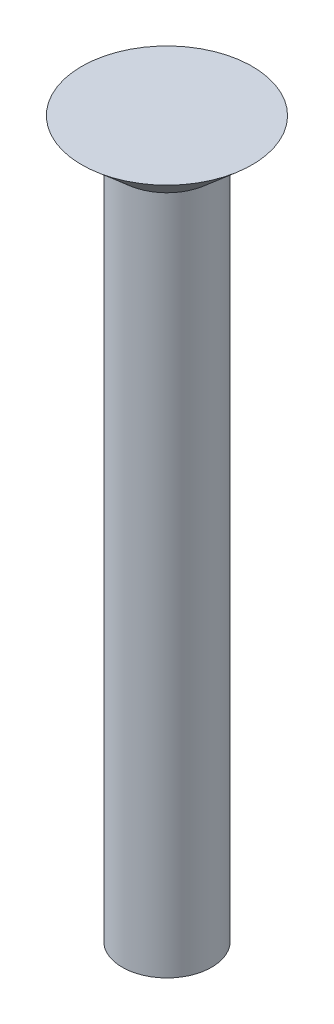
from build123d import *


with BuildPart() as part:
    # Sketch1 → Revolve1 (revolve)
    with BuildSketch(Plane.XY, mode=Mode.PRIVATE) as revolve1_sk:
        Polygon((0, 0), (6.0579, 0), (3.175, -2.506066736), (3.175, -50.8), (0, -50.8), align=None)
    revolve(revolve1_sk.sketch.rotate(Axis((0, 0, 0), (0, -1, 0)), 180), axis=Axis((0, 0, 0), (0, -1, 0)))


solid = part.part
